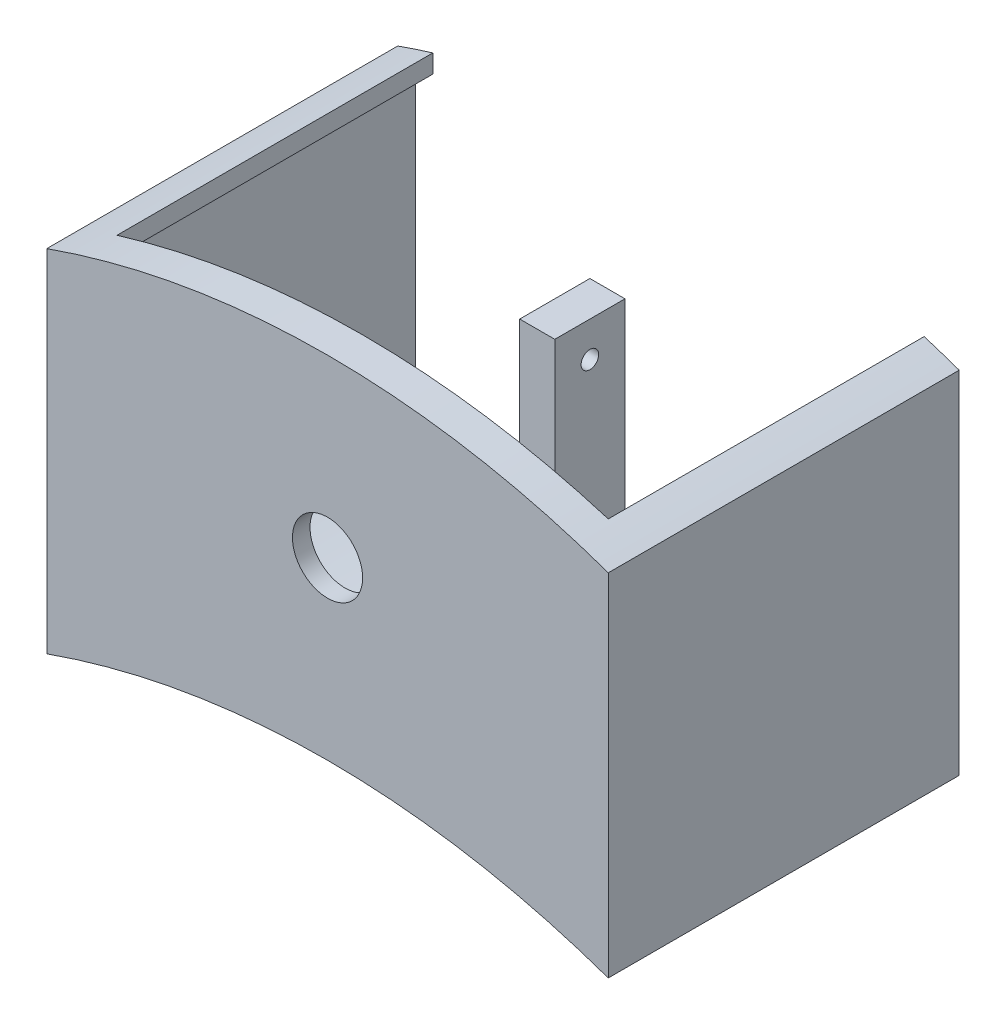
from build123d import *

# Parameters (mm, degrees)
EXTRUDE1_DEPTH = 31.75
EXTRUDE2_DEPTH = 30.1625
SKETCH4_R      = 3.175
EXTRUDE3_DEPTH = 70.946312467
EXTRUDE5_DEPTH = 28.575
SKETCH5_W      = 3.175
SKETCH5_H      = 6.35
EXTRUDE6_DEPTH = 25.4
EXTRUDE7_DEPTH = 69.5635089
EXTRUDE8_REACH = 57.175
SKETCH7_R      = 0.79375


with BuildPart() as part:
    # Sketch1 → Extrude1 (new body)
    with BuildSketch(Plane.XY):
        with BuildLine():
            Line((0, 0), (0, 31.75))
            ThreePointArc((0, 31.75), (25.4, 36.107951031), (50.8, 31.75))
            Line((50.8, 31.75), (50.8, 0))
            ThreePointArc((50.8, 0), (25.4, 4.357951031), (0, 0))
        make_face()
    extrude(amount=EXTRUDE1_DEPTH)

    # Sketch3 → Extrude2 (cut)
    with BuildSketch(Plane.XY):
        with BuildLine():
            Line((1.5875, 2.211040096), (1.5875, 30.618558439))
            ThreePointArc((1.5875, 30.618558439), (25.4, 34.520451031), (49.2125, 30.618558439))
            Line((49.2125, 30.618558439), (49.2125, 2.211040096))
            ThreePointArc((49.2125, 2.211040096), (25.4, 5.945451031), (1.5875, 2.211040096))
        make_face()
    extrude(amount=EXTRUDE2_DEPTH, mode=Mode.SUBTRACT)

    # Sketch4 → Extrude3 (cut, through all)
    with BuildSketch(Plane.XY.offset(31.75)):
        with Locations((25.4, 20.232951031)):
            Circle(SKETCH4_R)
    extrude(amount=-EXTRUDE3_DEPTH, mode=Mode.SUBTRACT)

    # 3DSketch1 → Extrude5 (cut)
    with BuildSketch(Plane(origin=(47.625, 28.758198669, 0), x_dir=(-0.9832858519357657, 0.18206848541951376, 0), z_dir=(0, 0, 1))):
        Polygon((0, 0), (43.707056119, 8.092944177), (45.205572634, 0), (1.498516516, -8.092944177), align=None)
    extrude(amount=EXTRUDE5_DEPTH, mode=Mode.SUBTRACT)

    # Sketch5 → Extrude6 (add)
    with BuildSketch(Plane(origin=(0, 0, 0), x_dir=(1, 0, 0), z_dir=(0, 1, 0))):
        with Locations((22.1488, -6.35)):
            Rectangle(SKETCH5_W, SKETCH5_H)
    extrude(amount=EXTRUDE6_DEPTH)

    # Sketch6 → Extrude7 (cut, through all)
    with BuildSketch(Plane(origin=(0, 0, 3.175), x_dir=(-1, 0, 0), z_dir=(0, 0, -1))):
        with BuildLine():
            Line((-20.5613, 4.204167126), (-20.5613, 0))
            Line((-20.5613, 0), (-23.7363, 0))
            Line((-23.7363, 0), (-23.7363, 4.339786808))
            ThreePointArc((-23.7363, 4.339786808), (-22.148092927, 4.288530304), (-20.5613, 4.204167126))
        make_face()
    extrude(amount=-EXTRUDE7_DEPTH, mode=Mode.SUBTRACT)

    # Sketch7 → Extrude8 (cut, up to next)
    with BuildSketch(Plane(origin=(23.7363, 0, 0), x_dir=(0, 0, -1), z_dir=(1, 0, 0)), mode=Mode.PRIVATE) as extrude8_sk1:
        with Locations((-6.35, 22.225)):
            Circle(SKETCH7_R)
    extrude8_tool1 = extrude(extrude8_sk1.sketch, amount=-EXTRUDE8_REACH, mode=Mode.PRIVATE) & part.part
    add(extrude8_tool1.solids().sort_by_distance((23.7363, 22.225, 6.35))[0], mode=Mode.SUBTRACT)


solid = part.part
